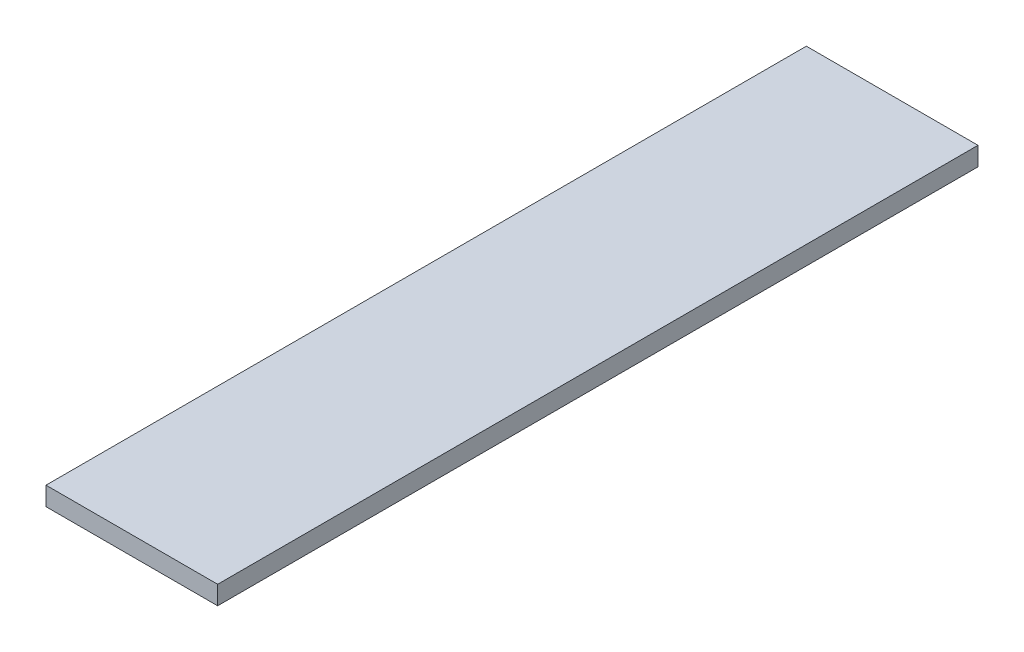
from build123d import *

# Parameters (mm, degrees)
SKETCH1_W           = 1168.4
SKETCH1_H           = 5175.34144
BOSS_EXTRUDE1_DEPTH = 127


with BuildPart() as part:
    # Sketch1 → Boss-Extrude1 (new body)
    with BuildSketch(Plane(origin=(0, 0, 0), x_dir=(1, 0, 0), z_dir=(0, 1, 0))):
        Rectangle(SKETCH1_W, SKETCH1_H)
    extrude(amount=BOSS_EXTRUDE1_DEPTH)


solid = part.part
